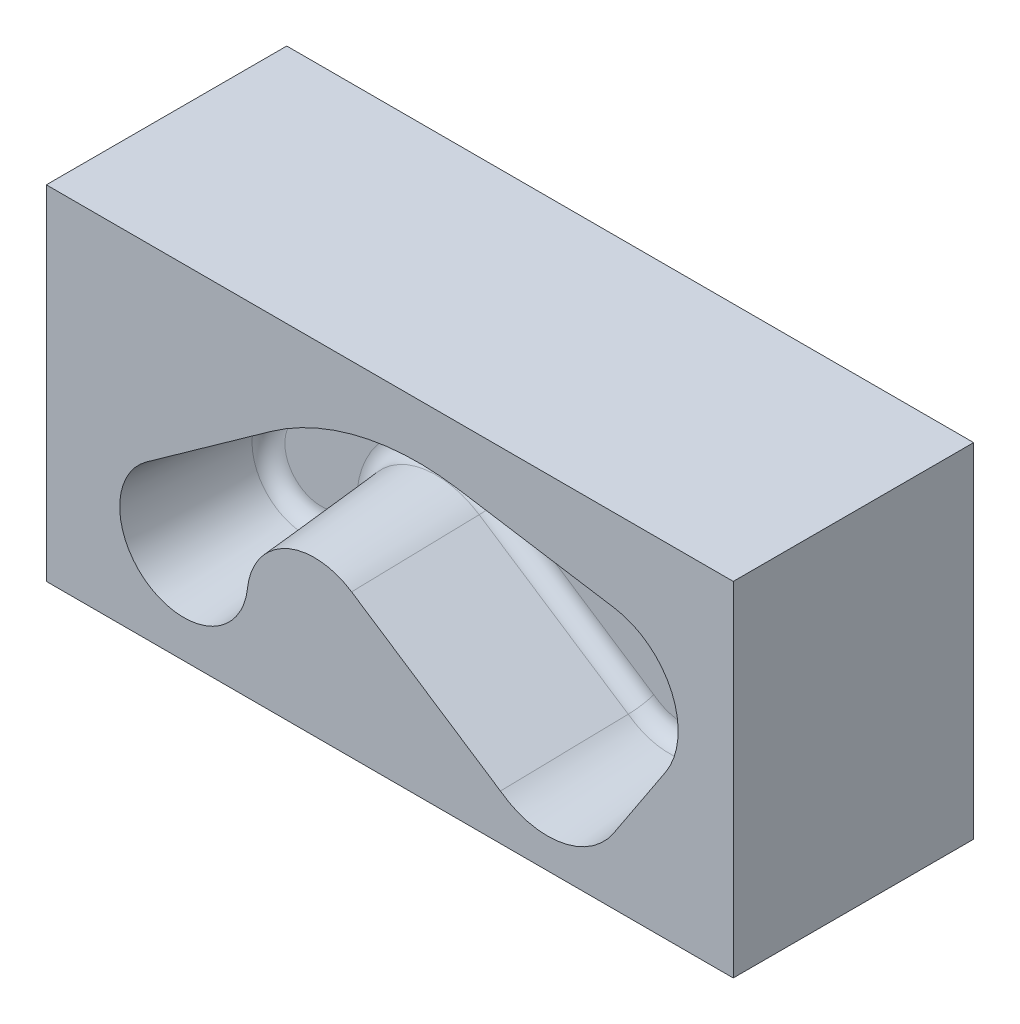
ISO-10303-21;
HEADER;
FILE_DESCRIPTION(('STEP AP214'),'2;1');
FILE_NAME('part.step','',(''),(''),'','','');
FILE_SCHEMA(('AUTOMOTIVE_DESIGN { 1 0 10303 214 1 1 1 1 }'));
ENDSEC;
DATA;
#1=APPLICATION_CONTEXT('core data for automotive mechanical design processes');
#2=APPLICATION_PROTOCOL_DEFINITION('international standard','automotive_design',2000,#1);
#3=PRODUCT_CONTEXT('',#1,'mechanical');
#4=PRODUCT('Part','Part','',(#3));
#5=PRODUCT_RELATED_PRODUCT_CATEGORY('part','',(#4));
#6=PRODUCT_DEFINITION_FORMATION('','',#4);
#7=PRODUCT_DEFINITION_CONTEXT('part definition',#1,'design');
#8=PRODUCT_DEFINITION('design','',#6,#7);
#9=PRODUCT_DEFINITION_SHAPE('','',#8);
#10=(LENGTH_UNIT() NAMED_UNIT(*) SI_UNIT(.MILLI.,.METRE.));
#11=(NAMED_UNIT(*) PLANE_ANGLE_UNIT() SI_UNIT($,.RADIAN.));
#12=(NAMED_UNIT(*) SI_UNIT($,.STERADIAN.) SOLID_ANGLE_UNIT());
#13=UNCERTAINTY_MEASURE_WITH_UNIT(LENGTH_MEASURE(1.E-05),#10,'distance_accuracy_value','');
#14=(GEOMETRIC_REPRESENTATION_CONTEXT(3) GLOBAL_UNCERTAINTY_ASSIGNED_CONTEXT((#13)) GLOBAL_UNIT_ASSIGNED_CONTEXT((#10,
#11,#12)) REPRESENTATION_CONTEXT('',''));
#15=CARTESIAN_POINT('',(0.,0.,0.));
#16=DIRECTION('',(0.,0.,1.));
#17=DIRECTION('',(1.,0.,0.));
#18=AXIS2_PLACEMENT_3D('',#15,#16,#17);
#19=CARTESIAN_POINT('',(0.,100.,70.));
#20=DIRECTION('',(0.,0.,-1.));
#21=DIRECTION('',(-1.,0.,0.));
#22=AXIS2_PLACEMENT_3D('',#19,#20,#21);
#23=PLANE('',#22);
#24=DIRECTION('',(0.,-1.,0.));
#25=VECTOR('',#24,1.);
#26=CARTESIAN_POINT('',(0.,0.,70.));
#27=LINE('',#26,#25);
#28=CARTESIAN_POINT('',(0.,100.,70.));
#29=VERTEX_POINT('',#28);
#30=CARTESIAN_POINT('',(0.,0.,70.));
#31=VERTEX_POINT('',#30);
#32=EDGE_CURVE('E283',#29,#31,#27,.T.);
#33=ORIENTED_EDGE('',*,*,#32,.T.);
#34=DIRECTION('',(1.,0.,0.));
#35=VECTOR('',#34,1.);
#36=CARTESIAN_POINT('',(0.,0.,70.));
#37=LINE('',#36,#35);
#38=CARTESIAN_POINT('',(200.,0.,70.));
#39=VERTEX_POINT('',#38);
#40=EDGE_CURVE('E288',#31,#39,#37,.T.);
#41=ORIENTED_EDGE('',*,*,#40,.T.);
#42=DIRECTION('',(0.,1.,0.));
#43=VECTOR('',#42,1.);
#44=CARTESIAN_POINT('',(200.,0.,70.));
#45=LINE('',#44,#43);
#46=CARTESIAN_POINT('',(200.,100.,70.));
#47=VERTEX_POINT('',#46);
#48=EDGE_CURVE('E278',#39,#47,#45,.T.);
#49=ORIENTED_EDGE('',*,*,#48,.T.);
#50=DIRECTION('',(-1.,0.,0.));
#51=VECTOR('',#50,1.);
#52=CARTESIAN_POINT('',(0.,100.,70.));
#53=LINE('',#52,#51);
#54=EDGE_CURVE('E51',#47,#29,#53,.T.);
#55=ORIENTED_EDGE('',*,*,#54,.T.);
#56=EDGE_LOOP('',(#33,#41,#49,#55));
#57=FACE_BOUND('',#56,.T.);
#58=CARTESIAN_POINT('',(40.0212854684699,29.5414407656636,70.));
#59=DIRECTION('',(0.,0.,1.));
#60=DIRECTION('',(-1.,0.,0.));
#61=AXIS2_PLACEMENT_3D('',#58,#59,#60);
#62=CIRCLE('',#61,18.65393792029);
#63=CARTESIAN_POINT('',(29.1987892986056,44.7349583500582,70.));
#64=VERTEX_POINT('',#63);
#65=CARTESIAN_POINT('',(58.566379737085,27.5292582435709,70.));
#66=VERTEX_POINT('',#65);
#67=EDGE_CURVE('E158',#64,#66,#62,.T.);
#68=ORIENTED_EDGE('',*,*,#67,.F.);
#69=DIRECTION('',(-0.814493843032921,-0.580172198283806,0.));
#70=VECTOR('',#69,1.);
#71=CARTESIAN_POINT('',(29.1987892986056,44.7349583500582,70.));
#72=LINE('',#71,#70);
#73=CARTESIAN_POINT('',(65.2196540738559,70.3929844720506,70.));
#74=VERTEX_POINT('',#73);
#75=EDGE_CURVE('E168',#74,#64,#72,.T.);
#76=ORIENTED_EDGE('',*,*,#75,.F.);
#77=CARTESIAN_POINT('',(108.267026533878,9.95951328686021,70.));
#78=DIRECTION('',(0.,0.,1.));
#79=DIRECTION('',(-1.,0.,0.));
#80=AXIS2_PLACEMENT_3D('',#77,#78,#79);
#81=CIRCLE('',#80,74.1975789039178);
#82=CARTESIAN_POINT('',(119.935714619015,83.2338091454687,70.));
#83=VERTEX_POINT('',#82);
#84=EDGE_CURVE('E43',#83,#74,#81,.T.);
#85=ORIENTED_EDGE('',*,*,#84,.F.);
#86=DIRECTION('',(-0.98755642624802,0.157265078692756,0.));
#87=VECTOR('',#86,1.);
#88=CARTESIAN_POINT('',(119.935714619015,83.2338091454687,70.));
#89=LINE('',#88,#87);
#90=CARTESIAN_POINT('',(165.383794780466,75.9963534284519,70.));
#91=VERTEX_POINT('',#90);
#92=EDGE_CURVE('E196',#91,#83,#89,.T.);
#93=ORIENTED_EDGE('',*,*,#92,.F.);
#94=CARTESIAN_POINT('',(161.917100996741,54.227021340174,70.));
#95=DIRECTION('',(0.,0.,1.));
#96=DIRECTION('',(-1.,0.,0.));
#97=AXIS2_PLACEMENT_3D('',#94,#95,#96);
#98=CIRCLE('',#97,22.0436336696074);
#99=CARTESIAN_POINT('',(180.323972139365,42.0981763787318,70.));
#100=VERTEX_POINT('',#99);
#101=EDGE_CURVE('E193',#100,#91,#98,.T.);
#102=ORIENTED_EDGE('',*,*,#101,.F.);
#103=DIRECTION('',(0.550219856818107,0.835019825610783,0.));
#104=VECTOR('',#103,1.);
#105=CARTESIAN_POINT('',(180.323972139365,42.0981763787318,70.));
#106=LINE('',#105,#104);
#107=CARTESIAN_POINT('',(165.211251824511,19.1629425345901,70.));
#108=VERTEX_POINT('',#107);
#109=EDGE_CURVE('E190',#108,#100,#106,.T.);
#110=ORIENTED_EDGE('',*,*,#109,.F.);
#111=CARTESIAN_POINT('',(145.905558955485,31.8840483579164,70.));
#112=DIRECTION('',(0.,0.,1.));
#113=DIRECTION('',(-1.,0.,0.));
#114=AXIS2_PLACEMENT_3D('',#111,#112,#113);
#115=CIRCLE('',#114,23.1200413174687);
#116=CARTESIAN_POINT('',(132.214066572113,13.2539826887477,70.));
#117=VERTEX_POINT('',#116);
#118=EDGE_CURVE('E187',#117,#108,#115,.T.);
#119=ORIENTED_EDGE('',*,*,#118,.F.);
#120=DIRECTION('',(0.835019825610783,-0.550219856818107,0.));
#121=VECTOR('',#120,1.);
#122=CARTESIAN_POINT('',(132.214066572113,13.2539826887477,70.));
#123=LINE('',#122,#121);
#124=CARTESIAN_POINT('',(88.8854300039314,41.8045337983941,70.));
#125=VERTEX_POINT('',#124);
#126=EDGE_CURVE('E178',#125,#117,#123,.T.);
#127=ORIENTED_EDGE('',*,*,#126,.F.);
#128=CARTESIAN_POINT('',(78.0836261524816,25.4115951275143,70.));
#129=DIRECTION('',(0.,0.,-1.));
#130=DIRECTION('',(1.,0.,0.));
#131=AXIS2_PLACEMENT_3D('',#128,#129,#130);
#132=CIRCLE('',#131,19.6317957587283);
#133=EDGE_CURVE('E175',#66,#125,#132,.T.);
#134=ORIENTED_EDGE('',*,*,#133,.F.);
#135=EDGE_LOOP('',(#68,#76,#85,#93,#102,#110,#119,#127,#134));
#136=FACE_BOUND('',#135,.T.);
#137=ADVANCED_FACE('F28',(#57,#136),#23,.F.);
#138=CARTESIAN_POINT('',(0.,0.,70.));
#139=DIRECTION('',(1.,0.,0.));
#140=DIRECTION('',(0.,0.,-1.));
#141=AXIS2_PLACEMENT_3D('',#138,#139,#140);
#142=PLANE('',#141);
#143=DIRECTION('',(0.,-1.,0.));
#144=VECTOR('',#143,1.);
#145=CARTESIAN_POINT('',(0.,0.,0.));
#146=LINE('',#145,#144);
#147=CARTESIAN_POINT('',(0.,100.,0.));
#148=VERTEX_POINT('',#147);
#149=CARTESIAN_POINT('',(0.,0.,0.));
#150=VERTEX_POINT('',#149);
#151=EDGE_CURVE('E274',#148,#150,#146,.T.);
#152=ORIENTED_EDGE('',*,*,#151,.T.);
#153=DIRECTION('',(0.,0.,-1.));
#154=VECTOR('',#153,1.);
#155=CARTESIAN_POINT('',(0.,0.,70.));
#156=LINE('',#155,#154);
#157=EDGE_CURVE('E11',#31,#150,#156,.T.);
#158=ORIENTED_EDGE('',*,*,#157,.F.);
#159=ORIENTED_EDGE('',*,*,#32,.F.);
#160=DIRECTION('',(0.,0.,-1.));
#161=VECTOR('',#160,1.);
#162=CARTESIAN_POINT('',(0.,100.,70.));
#163=LINE('',#162,#161);
#164=EDGE_CURVE('E292',#29,#148,#163,.T.);
#165=ORIENTED_EDGE('',*,*,#164,.T.);
#166=EDGE_LOOP('',(#152,#158,#159,#165));
#167=FACE_BOUND('',#166,.T.);
#168=ADVANCED_FACE('F30',(#167),#142,.F.);
#169=CARTESIAN_POINT('',(0.,0.,70.));
#170=DIRECTION('',(0.,1.,0.));
#171=DIRECTION('',(0.,0.,1.));
#172=AXIS2_PLACEMENT_3D('',#169,#170,#171);
#173=PLANE('',#172);
#174=DIRECTION('',(1.,0.,0.));
#175=VECTOR('',#174,1.);
#176=CARTESIAN_POINT('',(0.,0.,0.));
#177=LINE('',#176,#175);
#178=CARTESIAN_POINT('',(200.,0.,0.));
#179=VERTEX_POINT('',#178);
#180=EDGE_CURVE('E266',#150,#179,#177,.T.);
#181=ORIENTED_EDGE('',*,*,#180,.T.);
#182=DIRECTION('',(0.,0.,-1.));
#183=VECTOR('',#182,1.);
#184=CARTESIAN_POINT('',(200.,0.,70.));
#185=LINE('',#184,#183);
#186=EDGE_CURVE('E36',#39,#179,#185,.T.);
#187=ORIENTED_EDGE('',*,*,#186,.F.);
#188=ORIENTED_EDGE('',*,*,#40,.F.);
#189=ORIENTED_EDGE('',*,*,#157,.T.);
#190=EDGE_LOOP('',(#181,#187,#188,#189));
#191=FACE_BOUND('',#190,.T.);
#192=ADVANCED_FACE('F256',(#191),#173,.F.);
#193=CARTESIAN_POINT('',(200.,0.,70.));
#194=DIRECTION('',(-1.,0.,0.));
#195=DIRECTION('',(0.,0.,1.));
#196=AXIS2_PLACEMENT_3D('',#193,#194,#195);
#197=PLANE('',#196);
#198=DIRECTION('',(0.,1.,0.));
#199=VECTOR('',#198,1.);
#200=CARTESIAN_POINT('',(200.,0.,0.));
#201=LINE('',#200,#199);
#202=CARTESIAN_POINT('',(200.,100.,0.));
#203=VERTEX_POINT('',#202);
#204=EDGE_CURVE('E273',#179,#203,#201,.T.);
#205=ORIENTED_EDGE('',*,*,#204,.T.);
#206=DIRECTION('',(0.,0.,-1.));
#207=VECTOR('',#206,1.);
#208=CARTESIAN_POINT('',(200.,100.,70.));
#209=LINE('',#208,#207);
#210=EDGE_CURVE('E279',#47,#203,#209,.T.);
#211=ORIENTED_EDGE('',*,*,#210,.F.);
#212=ORIENTED_EDGE('',*,*,#48,.F.);
#213=ORIENTED_EDGE('',*,*,#186,.T.);
#214=EDGE_LOOP('',(#205,#211,#212,#213));
#215=FACE_BOUND('',#214,.T.);
#216=ADVANCED_FACE('F253',(#215),#197,.F.);
#217=CARTESIAN_POINT('',(0.,100.,70.));
#218=DIRECTION('',(0.,-1.,0.));
#219=DIRECTION('',(0.,0.,-1.));
#220=AXIS2_PLACEMENT_3D('',#217,#218,#219);
#221=PLANE('',#220);
#222=DIRECTION('',(-1.,0.,0.));
#223=VECTOR('',#222,1.);
#224=CARTESIAN_POINT('',(0.,100.,0.));
#225=LINE('',#224,#223);
#226=EDGE_CURVE('E281',#203,#148,#225,.T.);
#227=ORIENTED_EDGE('',*,*,#226,.T.);
#228=ORIENTED_EDGE('',*,*,#164,.F.);
#229=ORIENTED_EDGE('',*,*,#54,.F.);
#230=ORIENTED_EDGE('',*,*,#210,.T.);
#231=EDGE_LOOP('',(#227,#228,#229,#230));
#232=FACE_BOUND('',#231,.T.);
#233=ADVANCED_FACE('F247',(#232),#221,.F.);
#234=CARTESIAN_POINT('',(0.,100.,0.));
#235=DIRECTION('',(0.,0.,-1.));
#236=DIRECTION('',(-1.,0.,0.));
#237=AXIS2_PLACEMENT_3D('',#234,#235,#236);
#238=PLANE('',#237);
#239=ORIENTED_EDGE('',*,*,#151,.F.);
#240=ORIENTED_EDGE('',*,*,#226,.F.);
#241=ORIENTED_EDGE('',*,*,#204,.F.);
#242=ORIENTED_EDGE('',*,*,#180,.F.);
#243=EDGE_LOOP('',(#239,#240,#241,#242));
#244=FACE_BOUND('',#243,.T.);
#245=ADVANCED_FACE('F223',(#244),#238,.T.);
#246=CARTESIAN_POINT('',(40.0212854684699,29.5414407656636,70.));
#247=DIRECTION('',(0.,0.,1.));
#248=DIRECTION('',(-1.,0.,0.));
#249=AXIS2_PLACEMENT_3D('',#246,#247,#248);
#250=CONICAL_SURFACE('',#249,18.65393792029,0.0872664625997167);
#251=DIRECTION('',(-0.0505653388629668,0.0709878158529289,0.996194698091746));
#252=VECTOR('',#251,1.);
#253=CARTESIAN_POINT('',(29.1987892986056,44.7349583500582,70.));
#254=LINE('',#253,#252);
#255=CARTESIAN_POINT('',(30.9974559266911,42.2098409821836,34.5642212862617));
#256=VERTEX_POINT('',#255);
#257=EDGE_CURVE('E153',#256,#64,#254,.T.);
#258=ORIENTED_EDGE('',*,*,#257,.T.);
#259=ORIENTED_EDGE('',*,*,#67,.T.);
#260=DIRECTION('',(0.0866471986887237,-0.00940140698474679,0.996194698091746));
#261=VECTOR('',#260,1.);
#262=CARTESIAN_POINT('',(58.566379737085,27.5292582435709,70.));
#263=LINE('',#262,#261);
#264=CARTESIAN_POINT('',(55.4842403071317,27.8636769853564,34.5642212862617));
#265=VERTEX_POINT('',#264);
#266=EDGE_CURVE('E171',#265,#66,#263,.T.);
#267=ORIENTED_EDGE('',*,*,#266,.F.);
#268=CARTESIAN_POINT('',(40.0212854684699,29.5414407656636,34.5642212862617));
#269=DIRECTION('',(0.,0.,-1.));
#270=DIRECTION('',(-1.,0.,0.));
#271=AXIS2_PLACEMENT_3D('',#268,#269,#270);
#272=CIRCLE('',#271,15.5537089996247);
#273=EDGE_CURVE('E160',#256,#265,#272,.F.);
#274=ORIENTED_EDGE('',*,*,#273,.F.);
#275=EDGE_LOOP('',(#258,#259,#267,#274));
#276=FACE_BOUND('',#275,.T.);
#277=ADVANCED_FACE('F155',(#276),#250,.F.);
#278=CARTESIAN_POINT('',(29.1987892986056,44.7349583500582,70.));
#279=DIRECTION('',(-0.577964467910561,0.811394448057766,-0.0871557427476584));
#280=DIRECTION('',(-0.814493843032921,-0.580172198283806,0.));
#281=AXIS2_PLACEMENT_3D('',#278,#279,#280);
#282=PLANE('',#281);
#283=DIRECTION('',(-0.0505653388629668,0.0709878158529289,0.996194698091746));
#284=VECTOR('',#283,1.);
#285=CARTESIAN_POINT('',(65.2196540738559,70.3929844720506,70.));
#286=LINE('',#285,#284);
#287=CARTESIAN_POINT('',(67.0183207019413,67.867867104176,34.5642212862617));
#288=VERTEX_POINT('',#287);
#289=EDGE_CURVE('E165',#288,#74,#286,.T.);
#290=ORIENTED_EDGE('',*,*,#289,.T.);
#291=ORIENTED_EDGE('',*,*,#75,.T.);
#292=ORIENTED_EDGE('',*,*,#257,.F.);
#293=DIRECTION('',(-0.814493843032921,-0.580172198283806,0.));
#294=VECTOR('',#293,1.);
#295=CARTESIAN_POINT('',(30.9974559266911,42.2098409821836,34.5642212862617));
#296=LINE('',#295,#294);
#297=EDGE_CURVE('E296',#288,#256,#296,.T.);
#298=ORIENTED_EDGE('',*,*,#297,.F.);
#299=EDGE_LOOP('',(#290,#291,#292,#298));
#300=FACE_BOUND('',#299,.T.);
#301=ADVANCED_FACE('F169',(#300),#282,.F.);
#302=CARTESIAN_POINT('',(108.267026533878,9.95951328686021,70.));
#303=DIRECTION('',(0.,0.,1.));
#304=DIRECTION('',(-1.,0.,0.));
#305=AXIS2_PLACEMENT_3D('',#302,#303,#304);
#306=CONICAL_SURFACE('',#305,74.1975789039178,0.0872664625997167);
#307=DIRECTION('',(0.0137065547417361,0.0860712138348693,0.996194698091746));
#308=VECTOR('',#307,1.);
#309=CARTESIAN_POINT('',(119.935714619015,83.2338091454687,70.));
#310=LINE('',#309,#308);
#311=CARTESIAN_POINT('',(119.448156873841,80.1721581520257,34.5642212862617));
#312=VERTEX_POINT('',#311);
#313=EDGE_CURVE('E334',#312,#83,#310,.T.);
#314=ORIENTED_EDGE('',*,*,#313,.T.);
#315=ORIENTED_EDGE('',*,*,#84,.T.);
#316=ORIENTED_EDGE('',*,*,#289,.F.);
#317=CARTESIAN_POINT('',(108.267026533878,9.95951328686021,34.5642212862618));
#318=DIRECTION('',(0.,0.,-1.));
#319=DIRECTION('',(-1.,0.,0.));
#320=AXIS2_PLACEMENT_3D('',#317,#318,#319);
#321=CIRCLE('',#320,71.0973499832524);
#322=EDGE_CURVE('E300',#312,#288,#321,.F.);
#323=ORIENTED_EDGE('',*,*,#322,.F.);
#324=EDGE_LOOP('',(#314,#315,#316,#323));
#325=FACE_BOUND('',#324,.T.);
#326=ADVANCED_FACE('F239',(#325),#306,.F.);
#327=CARTESIAN_POINT('',(119.935714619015,83.2338091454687,70.));
#328=DIRECTION('',(0.156666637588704,0.98379847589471,-0.0871557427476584));
#329=DIRECTION('',(-0.98755642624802,0.157265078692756,0.));
#330=AXIS2_PLACEMENT_3D('',#327,#328,#329);
#331=PLANE('',#330);
#332=DIRECTION('',(0.0137065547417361,0.0860712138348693,0.996194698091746));
#333=VECTOR('',#332,1.);
#334=CARTESIAN_POINT('',(165.383794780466,75.996353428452,70.));
#335=LINE('',#334,#333);
#336=CARTESIAN_POINT('',(164.896237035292,72.9347024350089,34.5642212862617));
#337=VERTEX_POINT('',#336);
#338=EDGE_CURVE('E336',#337,#91,#335,.T.);
#339=ORIENTED_EDGE('',*,*,#338,.T.);
#340=ORIENTED_EDGE('',*,*,#92,.T.);
#341=ORIENTED_EDGE('',*,*,#313,.F.);
#342=DIRECTION('',(-0.98755642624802,0.157265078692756,0.));
#343=VECTOR('',#342,1.);
#344=CARTESIAN_POINT('',(119.448156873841,80.1721581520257,34.5642212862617));
#345=LINE('',#344,#343);
#346=EDGE_CURVE('E302',#337,#312,#345,.T.);
#347=ORIENTED_EDGE('',*,*,#346,.F.);
#348=EDGE_LOOP('',(#339,#340,#341,#347));
#349=FACE_BOUND('',#348,.T.);
#350=ADVANCED_FACE('F235',(#349),#331,.F.);
#351=CARTESIAN_POINT('',(161.917100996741,54.227021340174,70.));
#352=DIRECTION('',(0.,0.,1.));
#353=DIRECTION('',(-1.,0.,0.));
#354=AXIS2_PLACEMENT_3D('',#351,#352,#353);
#355=CONICAL_SURFACE('',#354,22.0436336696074,0.0872664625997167);
#356=DIRECTION('',(0.0727767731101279,-0.0479548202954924,0.996194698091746));
#357=VECTOR('',#356,1.);
#358=CARTESIAN_POINT('',(180.323972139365,42.0981763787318,70.));
#359=LINE('',#358,#357);
#360=CARTESIAN_POINT('',(177.735219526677,43.8039838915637,34.5642212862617));
#361=VERTEX_POINT('',#360);
#362=EDGE_CURVE('E337',#361,#100,#359,.T.);
#363=ORIENTED_EDGE('',*,*,#362,.T.);
#364=ORIENTED_EDGE('',*,*,#101,.T.);
#365=ORIENTED_EDGE('',*,*,#338,.F.);
#366=CARTESIAN_POINT('',(161.917100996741,54.227021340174,34.5642212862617));
#367=DIRECTION('',(0.,0.,-1.));
#368=DIRECTION('',(-1.,0.,0.));
#369=AXIS2_PLACEMENT_3D('',#366,#367,#368);
#370=CIRCLE('',#369,18.943404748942);
#371=EDGE_CURVE('E304',#361,#337,#370,.F.);
#372=ORIENTED_EDGE('',*,*,#371,.F.);
#373=EDGE_LOOP('',(#363,#364,#365,#372));
#374=FACE_BOUND('',#373,.T.);
#375=ADVANCED_FACE('F231',(#374),#355,.F.);
#376=CARTESIAN_POINT('',(180.323972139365,42.0981763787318,70.));
#377=DIRECTION('',(0.831842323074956,-0.548126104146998,-0.0871557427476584));
#378=DIRECTION('',(0.550219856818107,0.835019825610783,0.));
#379=AXIS2_PLACEMENT_3D('',#376,#377,#378);
#380=PLANE('',#379);
#381=DIRECTION('',(0.0727767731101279,-0.0479548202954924,0.996194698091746));
#382=VECTOR('',#381,1.);
#383=CARTESIAN_POINT('',(165.211251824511,19.16294253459,70.));
#384=LINE('',#383,#382);
#385=CARTESIAN_POINT('',(162.622499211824,20.8687500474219,34.5642212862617));
#386=VERTEX_POINT('',#385);
#387=EDGE_CURVE('E210',#386,#108,#384,.T.);
#388=ORIENTED_EDGE('',*,*,#387,.T.);
#389=ORIENTED_EDGE('',*,*,#109,.T.);
#390=ORIENTED_EDGE('',*,*,#362,.F.);
#391=DIRECTION('',(0.550219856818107,0.835019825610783,0.));
#392=VECTOR('',#391,1.);
#393=CARTESIAN_POINT('',(177.735219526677,43.8039838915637,34.5642212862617));
#394=LINE('',#393,#392);
#395=EDGE_CURVE('E306',#386,#361,#394,.T.);
#396=ORIENTED_EDGE('',*,*,#395,.F.);
#397=EDGE_LOOP('',(#388,#389,#390,#396));
#398=FACE_BOUND('',#397,.T.);
#399=ADVANCED_FACE('F228',(#398),#380,.F.);
#400=CARTESIAN_POINT('',(145.905558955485,31.8840483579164,70.));
#401=DIRECTION('',(0.,0.,1.));
#402=DIRECTION('',(-1.,0.,0.));
#403=AXIS2_PLACEMENT_3D('',#400,#401,#402);
#404=CONICAL_SURFACE('',#403,23.1200413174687,0.0872664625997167);
#405=CARTESIAN_POINT('',(134.217402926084,16.124897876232,30.));
#406=CARTESIAN_POINT('',(133.616182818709,15.2652472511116,41.9858792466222));
#407=CARTESIAN_POINT('',(133.015795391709,14.4050477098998,53.9717607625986));
#408=CARTESIAN_POINT('',(132.348838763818,13.4475340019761,67.3050963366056));
#409=CARTESIAN_POINT('',(132.281447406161,13.3507618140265,68.6525481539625));
#410=CARTESIAN_POINT('',(132.214066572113,13.2539826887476,70.));
#411=B_SPLINE_CURVE_WITH_KNOTS('',3,(#405,#406,#407,#408,#409,#410),.UNSPECIFIED.,.F.,.F.,(4,2,
4),(0.,36.0950949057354,40.1529016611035),.UNSPECIFIED.);
#412=CARTESIAN_POINT('',(133.98847786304,15.7975301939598,34.5642212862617));
#413=VERTEX_POINT('',#412);
#414=EDGE_CURVE('E203',#413,#117,#411,.T.);
#415=ORIENTED_EDGE('',*,*,#414,.T.);
#416=ORIENTED_EDGE('',*,*,#118,.T.);
#417=ORIENTED_EDGE('',*,*,#387,.F.);
#418=CARTESIAN_POINT('',(145.905558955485,31.8840483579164,34.5642212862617));
#419=DIRECTION('',(0.,0.,-1.));
#420=DIRECTION('',(-1.,0.,0.));
#421=AXIS2_PLACEMENT_3D('',#418,#419,#420);
#422=CIRCLE('',#421,20.0198123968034);
#423=EDGE_CURVE('E308',#413,#386,#422,.F.);
#424=ORIENTED_EDGE('',*,*,#423,.F.);
#425=EDGE_LOOP('',(#415,#416,#417,#424));
#426=FACE_BOUND('',#425,.T.);
#427=ADVANCED_FACE('F212',(#426),#404,.F.);
#428=CARTESIAN_POINT('',(132.214066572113,13.2539826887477,70.));
#429=DIRECTION('',(-0.548126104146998,-0.831842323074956,-0.0871557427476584));
#430=DIRECTION('',(0.835019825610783,-0.550219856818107,0.));
#431=AXIS2_PLACEMENT_3D('',#428,#429,#430);
#432=PLANE('',#431);
#433=DIRECTION('',(-0.0479548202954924,-0.0727767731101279,0.996194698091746));
#434=VECTOR('',#433,1.);
#435=CARTESIAN_POINT('',(88.8854300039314,41.8045337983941,70.));
#436=LINE('',#435,#434);
#437=CARTESIAN_POINT('',(90.5912375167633,44.3932864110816,34.5642212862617));
#438=VERTEX_POINT('',#437);
#439=EDGE_CURVE('E201',#438,#125,#436,.T.);
#440=ORIENTED_EDGE('',*,*,#439,.T.);
#441=ORIENTED_EDGE('',*,*,#126,.T.);
#442=ORIENTED_EDGE('',*,*,#414,.F.);
#443=DIRECTION('',(0.835019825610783,-0.550219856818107,0.));
#444=VECTOR('',#443,1.);
#445=CARTESIAN_POINT('',(133.919874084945,15.8427353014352,34.5642212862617));
#446=LINE('',#445,#444);
#447=EDGE_CURVE('E310',#438,#413,#446,.T.);
#448=ORIENTED_EDGE('',*,*,#447,.F.);
#449=EDGE_LOOP('',(#440,#441,#442,#448));
#450=FACE_BOUND('',#449,.T.);
#451=ADVANCED_FACE('F215',(#450),#432,.F.);
#452=CARTESIAN_POINT('',(78.0836261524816,25.4115951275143,70.));
#453=DIRECTION('',(0.,0.,-1.));
#454=DIRECTION('',(1.,0.,0.));
#455=AXIS2_PLACEMENT_3D('',#452,#453,#454);
#456=CONICAL_SURFACE('',#455,19.6317957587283,0.0872664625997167);
#457=ORIENTED_EDGE('',*,*,#266,.T.);
#458=ORIENTED_EDGE('',*,*,#133,.T.);
#459=ORIENTED_EDGE('',*,*,#439,.F.);
#460=CARTESIAN_POINT('',(78.0836261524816,25.4115951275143,34.5642212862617));
#461=DIRECTION('',(0.,0.,1.));
#462=DIRECTION('',(1.,0.,0.));
#463=AXIS2_PLACEMENT_3D('',#460,#461,#462);
#464=CIRCLE('',#463,22.7320246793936);
#465=EDGE_CURVE('E164',#265,#438,#464,.F.);
#466=ORIENTED_EDGE('',*,*,#465,.F.);
#467=EDGE_LOOP('',(#457,#458,#459,#466));
#468=FACE_BOUND('',#467,.T.);
#469=ADVANCED_FACE('F219',(#468),#456,.T.);
#470=CARTESIAN_POINT('',(40.0212854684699,29.5414407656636,30.));
#471=DIRECTION('',(0.,0.,-1.));
#472=DIRECTION('',(-1.,0.,0.));
#473=AXIS2_PLACEMENT_3D('',#470,#471,#472);
#474=PLANE('',#473);
#475=DIRECTION('',(0.835019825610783,-0.550219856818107,0.));
#476=VECTOR('',#475,1.);
#477=CARTESIAN_POINT('',(64.8951575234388,67.2903079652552,30.));
#478=LINE('',#477,#476);
#479=CARTESIAN_POINT('',(136.85161799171,19.8760165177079,30.));
#480=VERTEX_POINT('',#479);
#481=CARTESIAN_POINT('',(93.3318680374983,48.5524980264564,30.));
#482=VERTEX_POINT('',#481);
#483=EDGE_CURVE('E315',#480,#482,#478,.F.);
#484=ORIENTED_EDGE('',*,*,#483,.F.);
#485=CARTESIAN_POINT('',(145.905558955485,31.8840483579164,30.));
#486=DIRECTION('',(0.,0.,-1.));
#487=DIRECTION('',(-1.,0.,0.));
#488=AXIS2_PLACEMENT_3D('',#485,#486,#487);
#489=CIRCLE('',#488,15.0388389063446);
#490=CARTESIAN_POINT('',(158.463287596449,23.6093805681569,30.));
#491=VERTEX_POINT('',#490);
#492=EDGE_CURVE('E317',#491,#480,#489,.T.);
#493=ORIENTED_EDGE('',*,*,#492,.F.);
#494=DIRECTION('',(0.550219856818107,0.835019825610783,0.));
#495=VECTOR('',#494,1.);
#496=CARTESIAN_POINT('',(125.331384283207,-26.6719674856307,30.));
#497=LINE('',#496,#495);
#498=CARTESIAN_POINT('',(173.576007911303,46.5446144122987,30.));
#499=VERTEX_POINT('',#498);
#500=EDGE_CURVE('E319',#499,#491,#497,.F.);
#501=ORIENTED_EDGE('',*,*,#500,.F.);
#502=CARTESIAN_POINT('',(161.917100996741,54.227021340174,30.));
#503=DIRECTION('',(0.,0.,-1.));
#504=DIRECTION('',(-1.,0.,0.));
#505=AXIS2_PLACEMENT_3D('',#502,#503,#504);
#506=CIRCLE('',#505,13.9624312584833);
#507=CARTESIAN_POINT('',(164.112903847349,68.0157100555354,30.));
#508=VERTEX_POINT('',#507);
#509=EDGE_CURVE('E321',#508,#499,#506,.T.);
#510=ORIENTED_EDGE('',*,*,#509,.F.);
#511=DIRECTION('',(-0.98755642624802,0.157265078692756,0.));
#512=VECTOR('',#511,1.);
#513=CARTESIAN_POINT('',(49.0657243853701,86.3365910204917,30.));
#514=LINE('',#513,#512);
#515=CARTESIAN_POINT('',(118.664823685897,75.2531657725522,30.));
#516=VERTEX_POINT('',#515);
#517=EDGE_CURVE('E323',#516,#508,#514,.F.);
#518=ORIENTED_EDGE('',*,*,#517,.F.);
#519=CARTESIAN_POINT('',(108.267026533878,9.95951328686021,30.));
#520=DIRECTION('',(0.,0.,-1.));
#521=DIRECTION('',(-1.,0.,0.));
#522=AXIS2_PLACEMENT_3D('',#519,#520,#521);
#523=CIRCLE('',#522,66.1163764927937);
#524=CARTESIAN_POINT('',(69.9081430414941,63.8108948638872,30.));
#525=VERTEX_POINT('',#524);
#526=EDGE_CURVE('E325',#525,#516,#523,.T.);
#527=ORIENTED_EDGE('',*,*,#526,.F.);
#528=DIRECTION('',(-0.814493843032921,-0.580172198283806,0.));
#529=VECTOR('',#528,1.);
#530=CARTESIAN_POINT('',(33.8872782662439,38.1528687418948,30.));
#531=LINE('',#530,#529);
#532=CARTESIAN_POINT('',(33.8872782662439,38.1528687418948,30.));
#533=VERTEX_POINT('',#532);
#534=EDGE_CURVE('E327',#533,#525,#531,.F.);
#535=ORIENTED_EDGE('',*,*,#534,.F.);
#536=CARTESIAN_POINT('',(40.0212854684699,29.5414407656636,30.));
#537=DIRECTION('',(0.,0.,-1.));
#538=DIRECTION('',(-1.,0.,0.));
#539=AXIS2_PLACEMENT_3D('',#536,#537,#538);
#540=CIRCLE('',#539,10.5727355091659);
#541=CARTESIAN_POINT('',(50.5323302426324,28.4009698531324,30.));
#542=VERTEX_POINT('',#541);
#543=EDGE_CURVE('E329',#542,#533,#540,.T.);
#544=ORIENTED_EDGE('',*,*,#543,.F.);
#545=CARTESIAN_POINT('',(78.0836261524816,25.4115951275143,30.));
#546=DIRECTION('',(0.,0.,-1.));
#547=DIRECTION('',(-1.,0.,0.));
#548=AXIS2_PLACEMENT_3D('',#545,#546,#547);
#549=CIRCLE('',#548,27.7129981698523);
#550=EDGE_CURVE('E312',#482,#542,#549,.F.);
#551=ORIENTED_EDGE('',*,*,#550,.F.);
#552=EDGE_LOOP('',(#484,#493,#501,#510,#518,#527,#535,#544,#551));
#553=FACE_BOUND('',#552,.T.);
#554=ADVANCED_FACE('F226',(#553),#474,.F.);
#555=CARTESIAN_POINT('',(118.664823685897,75.2531657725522,35.));
#556=DIRECTION('',(-0.98755642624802,0.157265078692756,0.));
#557=DIRECTION('',(-0.157265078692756,-0.98755642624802,0.));
#558=AXIS2_PLACEMENT_3D('',#555,#556,#557);
#559=CYLINDRICAL_SURFACE('',#558,5.);
#560=CARTESIAN_POINT('',(118.664823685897,75.2531657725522,35.));
#561=DIRECTION('',(-0.98755642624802,0.157265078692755,0.));
#562=DIRECTION('',(-0.157265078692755,-0.98755642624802,0.));
#563=AXIS2_PLACEMENT_3D('',#560,#561,#562);
#564=CIRCLE('',#563,5.);
#565=EDGE_CURVE('E181',#312,#516,#564,.T.);
#566=ORIENTED_EDGE('',*,*,#565,.T.);
#567=ORIENTED_EDGE('',*,*,#517,.T.);
#568=CARTESIAN_POINT('',(164.112903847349,68.0157100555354,35.));
#569=DIRECTION('',(0.98755642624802,-0.157265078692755,0.));
#570=DIRECTION('',(0.157265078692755,0.98755642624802,0.));
#571=AXIS2_PLACEMENT_3D('',#568,#569,#570);
#572=CIRCLE('',#571,5.);
#573=EDGE_CURVE('E176',#508,#337,#572,.T.);
#574=ORIENTED_EDGE('',*,*,#573,.T.);
#575=ORIENTED_EDGE('',*,*,#346,.T.);
#576=EDGE_LOOP('',(#566,#567,#574,#575));
#577=FACE_BOUND('',#576,.T.);
#578=ADVANCED_FACE('F358',(#577),#559,.F.);
#579=CARTESIAN_POINT('',(161.917100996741,54.227021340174,35.));
#580=DIRECTION('',(0.,0.,-1.));
#581=DIRECTION('',(-1.,0.,0.));
#582=AXIS2_PLACEMENT_3D('',#579,#580,#581);
#583=TOROIDAL_SURFACE('',#582,13.9624312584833,5.);
#584=ORIENTED_EDGE('',*,*,#573,.F.);
#585=ORIENTED_EDGE('',*,*,#509,.T.);
#586=CARTESIAN_POINT('',(173.576007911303,46.5446144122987,35.));
#587=DIRECTION('',(-0.550219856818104,-0.835019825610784,0.));
#588=DIRECTION('',(0.835019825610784,-0.550219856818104,0.));
#589=AXIS2_PLACEMENT_3D('',#586,#587,#588);
#590=CIRCLE('',#589,5.);
#591=EDGE_CURVE('E373',#499,#361,#590,.T.);
#592=ORIENTED_EDGE('',*,*,#591,.T.);
#593=ORIENTED_EDGE('',*,*,#371,.T.);
#594=EDGE_LOOP('',(#584,#585,#592,#593));
#595=FACE_BOUND('',#594,.T.);
#596=ADVANCED_FACE('F362',(#595),#583,.F.);
#597=CARTESIAN_POINT('',(108.267026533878,9.95951328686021,35.));
#598=DIRECTION('',(0.,0.,-1.));
#599=DIRECTION('',(-1.,0.,0.));
#600=AXIS2_PLACEMENT_3D('',#597,#598,#599);
#601=TOROIDAL_SURFACE('',#600,66.1163764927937,5.);
#602=ORIENTED_EDGE('',*,*,#565,.F.);
#603=ORIENTED_EDGE('',*,*,#322,.T.);
#604=CARTESIAN_POINT('',(69.9081430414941,63.8108948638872,35.));
#605=DIRECTION('',(-0.814493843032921,-0.580172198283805,0.));
#606=DIRECTION('',(0.580172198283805,-0.814493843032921,0.));
#607=AXIS2_PLACEMENT_3D('',#604,#605,#606);
#608=CIRCLE('',#607,5.);
#609=EDGE_CURVE('E378',#288,#525,#608,.T.);
#610=ORIENTED_EDGE('',*,*,#609,.T.);
#611=ORIENTED_EDGE('',*,*,#526,.T.);
#612=EDGE_LOOP('',(#602,#603,#610,#611));
#613=FACE_BOUND('',#612,.T.);
#614=ADVANCED_FACE('F390',(#613),#601,.F.);
#615=CARTESIAN_POINT('',(173.576007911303,46.5446144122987,35.));
#616=DIRECTION('',(0.550219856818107,0.835019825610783,0.));
#617=DIRECTION('',(-0.835019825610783,0.550219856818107,0.));
#618=AXIS2_PLACEMENT_3D('',#615,#616,#617);
#619=CYLINDRICAL_SURFACE('',#618,5.);
#620=ORIENTED_EDGE('',*,*,#591,.F.);
#621=ORIENTED_EDGE('',*,*,#500,.T.);
#622=CARTESIAN_POINT('',(158.463287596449,23.6093805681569,35.));
#623=DIRECTION('',(-0.550219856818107,-0.835019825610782,0.));
#624=DIRECTION('',(0.835019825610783,-0.550219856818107,0.));
#625=AXIS2_PLACEMENT_3D('',#622,#623,#624);
#626=CIRCLE('',#625,5.);
#627=EDGE_CURVE('E372',#491,#386,#626,.T.);
#628=ORIENTED_EDGE('',*,*,#627,.T.);
#629=ORIENTED_EDGE('',*,*,#395,.T.);
#630=EDGE_LOOP('',(#620,#621,#628,#629));
#631=FACE_BOUND('',#630,.T.);
#632=ADVANCED_FACE('F371',(#631),#619,.F.);
#633=CARTESIAN_POINT('',(33.8872782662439,38.1528687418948,35.));
#634=DIRECTION('',(-0.814493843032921,-0.580172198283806,0.));
#635=DIRECTION('',(0.580172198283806,-0.814493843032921,0.));
#636=AXIS2_PLACEMENT_3D('',#633,#634,#635);
#637=CYLINDRICAL_SURFACE('',#636,5.);
#638=ORIENTED_EDGE('',*,*,#609,.F.);
#639=ORIENTED_EDGE('',*,*,#297,.T.);
#640=CARTESIAN_POINT('',(33.8872782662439,38.1528687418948,35.));
#641=DIRECTION('',(-0.81449384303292,-0.580172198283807,0.));
#642=DIRECTION('',(0.580172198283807,-0.81449384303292,0.));
#643=AXIS2_PLACEMENT_3D('',#640,#641,#642);
#644=CIRCLE('',#643,5.);
#645=EDGE_CURVE('E379',#256,#533,#644,.T.);
#646=ORIENTED_EDGE('',*,*,#645,.T.);
#647=ORIENTED_EDGE('',*,*,#534,.T.);
#648=EDGE_LOOP('',(#638,#639,#646,#647));
#649=FACE_BOUND('',#648,.T.);
#650=ADVANCED_FACE('F393',(#649),#637,.F.);
#651=CARTESIAN_POINT('',(145.905558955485,31.8840483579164,35.));
#652=DIRECTION('',(0.,0.,-1.));
#653=DIRECTION('',(-1.,0.,0.));
#654=AXIS2_PLACEMENT_3D('',#651,#652,#653);
#655=TOROIDAL_SURFACE('',#654,15.0388389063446,5.);
#656=ORIENTED_EDGE('',*,*,#627,.F.);
#657=ORIENTED_EDGE('',*,*,#492,.T.);
#658=CARTESIAN_POINT('',(133.98847786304,15.7975301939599,34.5642212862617));
#659=CARTESIAN_POINT('',(133.995492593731,15.8075641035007,34.4241647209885));
#660=CARTESIAN_POINT('',(134.005909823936,15.8224653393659,34.2846301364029));
#661=CARTESIAN_POINT('',(134.033438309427,15.8618402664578,34.0075932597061));
#662=CARTESIAN_POINT('',(134.050549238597,15.8863134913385,33.8700908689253));
#663=CARTESIAN_POINT('',(134.091341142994,15.9446516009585,33.5981842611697));
#664=CARTESIAN_POINT('',(134.11501769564,15.9785101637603,33.4637780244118));
#665=CARTESIAN_POINT('',(134.168776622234,16.0553788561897,33.198923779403));
#666=CARTESIAN_POINT('',(134.198858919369,16.0983888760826,33.0684757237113));
#667=CARTESIAN_POINT('',(134.265229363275,16.1932680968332,32.8124235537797));
#668=CARTESIAN_POINT('',(134.301519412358,16.2451400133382,32.6868209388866));
#669=CARTESIAN_POINT('',(134.380058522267,16.3573824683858,32.4413490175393));
#670=CARTESIAN_POINT('',(134.42230977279,16.4177561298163,32.3214818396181));
#671=CARTESIAN_POINT('',(134.512435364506,16.5465132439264,32.0884573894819));
#672=CARTESIAN_POINT('',(134.560306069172,16.6148915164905,31.9752958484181));
#673=CARTESIAN_POINT('',(134.661374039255,16.7592245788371,31.7563638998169));
#674=CARTESIAN_POINT('',(134.714573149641,16.835181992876,31.6505960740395));
#675=CARTESIAN_POINT('',(134.825904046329,16.9941004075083,31.4472573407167));
#676=CARTESIAN_POINT('',(134.884035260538,17.0770605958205,31.3496854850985));
#677=CARTESIAN_POINT('',(135.004827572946,17.2493986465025,31.1634170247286));
#678=CARTESIAN_POINT('',(135.067488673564,17.3387765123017,31.0747204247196));
#679=CARTESIAN_POINT('',(135.196947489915,17.5233775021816,30.9067707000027));
#680=CARTESIAN_POINT('',(135.263748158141,17.6186047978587,30.8275244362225));
#681=CARTESIAN_POINT('',(135.400951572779,17.8141309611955,30.6791378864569));
#682=CARTESIAN_POINT('',(135.471353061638,17.9144280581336,30.609994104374));
#683=CARTESIAN_POINT('',(135.615382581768,18.119547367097,30.4821825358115));
#684=CARTESIAN_POINT('',(135.689014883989,18.2243755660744,30.4235291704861));
#685=CARTESIAN_POINT('',(135.83886948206,18.4376395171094,30.3172509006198));
#686=CARTESIAN_POINT('',(135.915090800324,18.5460739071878,30.2696218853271));
#687=CARTESIAN_POINT('',(136.069504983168,18.7656601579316,30.185758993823));
#688=CARTESIAN_POINT('',(136.14769503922,18.8768081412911,30.1495097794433));
#689=CARTESIAN_POINT('',(136.305566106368,19.1011292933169,30.0885888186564));
#690=CARTESIAN_POINT('',(136.385246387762,19.2143014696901,30.0639115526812));
#691=CARTESIAN_POINT('',(136.524032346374,19.4113362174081,30.0313347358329));
#692=CARTESIAN_POINT('',(136.582920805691,19.4949135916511,30.0207098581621));
#693=CARTESIAN_POINT('',(136.700945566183,19.6623642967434,30.0057791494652));
#694=CARTESIAN_POINT('',(136.760081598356,19.746237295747,30.0014676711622));
#695=CARTESIAN_POINT('',(136.830031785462,19.8454140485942,30.0001050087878));
#696=CARTESIAN_POINT('',(136.840824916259,19.8607158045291,29.9999999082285));
#697=CARTESIAN_POINT('',(136.85161799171,19.8760165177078,30.));
#698=B_SPLINE_CURVE_WITH_KNOTS('',3,(#658,#659,#660,#661,#662,#663,#664,#665,#666,#667,#668,
#669,#670,#671,#672,#673,#674,#675,#676,#677,#678,#679,#680,#681,#682,#683,#684,#685,#686,#687,
#688,#689,#690,#691,#692,#693,#694,#695,#696,#697),.UNSPECIFIED.,.F.,.F.,(4,2,2,2,2,2,2,2,2,2,2,
2,2,2,2,2,2,2,2,4),(0.,0.421643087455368,0.8432656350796,1.26460486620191,1.6859390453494,
2.1074025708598,2.52902131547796,2.95036870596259,3.37186249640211,3.79330746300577,
4.21475265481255,4.63650197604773,5.05810499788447,5.48028321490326,5.90230375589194,
6.32375301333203,6.74500104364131,7.05319770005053,7.36111850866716,7.41729381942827),.UNSPECIFIED.);
#699=EDGE_CURVE('E384',#480,#413,#698,.F.);
#700=ORIENTED_EDGE('',*,*,#699,.T.);
#701=ORIENTED_EDGE('',*,*,#423,.T.);
#702=EDGE_LOOP('',(#656,#657,#700,#701));
#703=FACE_BOUND('',#702,.T.);
#704=ADVANCED_FACE('F375',(#703),#655,.F.);
#705=CARTESIAN_POINT('',(40.0212854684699,29.5414407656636,35.));
#706=DIRECTION('',(0.,0.,-1.));
#707=DIRECTION('',(-1.,0.,0.));
#708=AXIS2_PLACEMENT_3D('',#705,#706,#707);
#709=TOROIDAL_SURFACE('',#708,10.5727355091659,5.);
#710=ORIENTED_EDGE('',*,*,#645,.F.);
#711=ORIENTED_EDGE('',*,*,#273,.T.);
#712=CARTESIAN_POINT('',(50.5323302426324,28.4009698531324,35.));
#713=DIRECTION('',(0.107869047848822,0.994165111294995,0.));
#714=DIRECTION('',(-0.994165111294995,0.107869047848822,0.));
#715=AXIS2_PLACEMENT_3D('',#712,#713,#714);
#716=CIRCLE('',#715,5.);
#717=EDGE_CURVE('E402',#265,#542,#716,.T.);
#718=ORIENTED_EDGE('',*,*,#717,.T.);
#719=ORIENTED_EDGE('',*,*,#543,.T.);
#720=EDGE_LOOP('',(#710,#711,#718,#719));
#721=FACE_BOUND('',#720,.T.);
#722=ADVANCED_FACE('F421',(#721),#709,.F.);
#723=CARTESIAN_POINT('',(136.66050460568,20.00194691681,35.));
#724=DIRECTION('',(0.835019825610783,-0.550219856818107,0.));
#725=DIRECTION('',(0.550219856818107,0.835019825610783,0.));
#726=AXIS2_PLACEMENT_3D('',#723,#724,#725);
#727=CYLINDRICAL_SURFACE('',#726,5.);
#728=ORIENTED_EDGE('',*,*,#699,.F.);
#729=ORIENTED_EDGE('',*,*,#483,.T.);
#730=CARTESIAN_POINT('',(93.3318680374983,48.5524980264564,35.));
#731=DIRECTION('',(-0.835019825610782,0.550219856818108,0.));
#732=DIRECTION('',(-0.550219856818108,-0.835019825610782,0.));
#733=AXIS2_PLACEMENT_3D('',#730,#731,#732);
#734=CIRCLE('',#733,5.);
#735=EDGE_CURVE('E404',#482,#438,#734,.T.);
#736=ORIENTED_EDGE('',*,*,#735,.T.);
#737=ORIENTED_EDGE('',*,*,#447,.T.);
#738=EDGE_LOOP('',(#728,#729,#736,#737));
#739=FACE_BOUND('',#738,.T.);
#740=ADVANCED_FACE('F415',(#739),#727,.F.);
#741=CARTESIAN_POINT('',(78.0836261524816,25.4115951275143,35.));
#742=DIRECTION('',(0.,0.,-1.));
#743=DIRECTION('',(-1.,0.,0.));
#744=AXIS2_PLACEMENT_3D('',#741,#742,#743);
#745=TOROIDAL_SURFACE('',#744,27.7129981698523,5.);
#746=ORIENTED_EDGE('',*,*,#717,.F.);
#747=ORIENTED_EDGE('',*,*,#465,.T.);
#748=ORIENTED_EDGE('',*,*,#735,.F.);
#749=ORIENTED_EDGE('',*,*,#550,.T.);
#750=EDGE_LOOP('',(#746,#747,#748,#749));
#751=FACE_BOUND('',#750,.T.);
#752=ADVANCED_FACE('F401',(#751),#745,.F.);
#753=CLOSED_SHELL('',(#137,#168,#192,#216,#233,#245,#277,#301,#326,#350,#375,#399,#427,#451,
#469,#554,#578,#596,#614,#632,#650,#704,#722,#740,#752));
#754=MANIFOLD_SOLID_BREP('B2',#753);
#755=ADVANCED_BREP_SHAPE_REPRESENTATION('',(#18,#754),#14);
#756=SHAPE_DEFINITION_REPRESENTATION(#9,#755);
ENDSEC;
END-ISO-10303-21;
